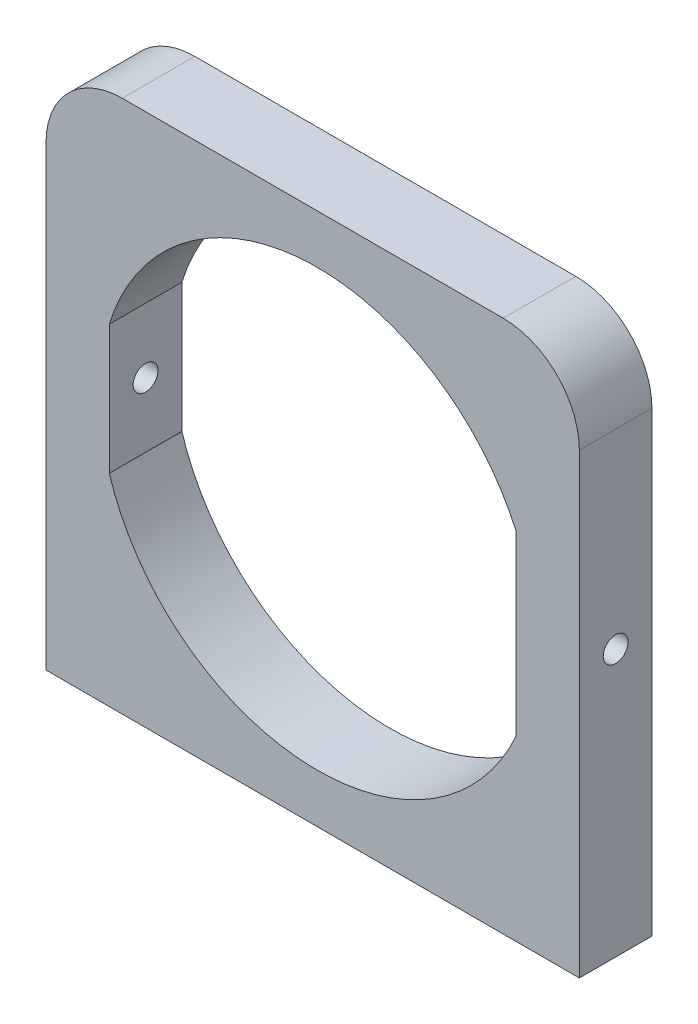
from build123d import *

# Parameters (mm, degrees)
SKETCH1_W                      = 70
SKETCH1_H                      = 70
BOSS_EXTRUDE1_DEPTH            = 9.525
F_4_CLEARANCE_HOLE1_D          = 3.2639
TAP_DRILL_FOR_8_32_TAP1_D      = 3.4544
TAP_DRILL_FOR_8_32_TAP1_DEPTH  = 12.7
TAP_DRILL_FOR_8_32_TAP1_TIP    = 1.037806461
F_1_8_0_1250_DOWEL_HOLE1_D     = 3.175
F_1_8_0_1250_DOWEL_HOLE1_DEPTH = 6.35
F_1_8_0_1250_DOWEL_HOLE1_TIP   = 0.953866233
CUT_EXTRUDE12_REACH            = 52.406
FILLET6_R                      = 10


with BuildPart() as part:
    # Sketch1 → Boss-Extrude1 (new body)
    with BuildSketch(Plane.XY):
        Rectangle(SKETCH1_W, SKETCH1_H)
    extrude(amount=BOSS_EXTRUDE1_DEPTH)

    # 4 Clearance Hole1 (through all)
    with Locations(Plane.ZY.offset(35)):
        with Locations((4.7625, 0)):
            Hole(F_4_CLEARANCE_HOLE1_D / 2)

    # Tap Drill for _8-32 Tap1
    with Locations(Plane(origin=(0, -35, 0), x_dir=(-1, 0, 0), z_dir=(0, -1, 0))):
        with Locations((28.65, -4.7625), (-28.65, -4.7625)):
            Hole(TAP_DRILL_FOR_8_32_TAP1_D / 2, depth=TAP_DRILL_FOR_8_32_TAP1_DEPTH)
            with Locations((0, 0, -(TAP_DRILL_FOR_8_32_TAP1_DEPTH + TAP_DRILL_FOR_8_32_TAP1_TIP / 2))):  # 118° drill point
                Cone(0, TAP_DRILL_FOR_8_32_TAP1_D / 2, TAP_DRILL_FOR_8_32_TAP1_TIP, mode=Mode.SUBTRACT)

    # 1_8 _0.1250_ Dowel Hole1
    with Locations(Plane(origin=(0, -35, 0), x_dir=(-1, 0, 0), z_dir=(0, -1, 0))):
        with Locations((15.95, -4.7625), (-15.95, -4.7625)):
            Hole(F_1_8_0_1250_DOWEL_HOLE1_D / 2, depth=F_1_8_0_1250_DOWEL_HOLE1_DEPTH)
            with Locations((0, 0, -(F_1_8_0_1250_DOWEL_HOLE1_DEPTH + F_1_8_0_1250_DOWEL_HOLE1_TIP / 2))):  # 118° drill point
                Cone(0, F_1_8_0_1250_DOWEL_HOLE1_D / 2, F_1_8_0_1250_DOWEL_HOLE1_TIP, mode=Mode.SUBTRACT)

    # Sketch22 → Cut-Extrude12 (cut, up to next)
    with BuildSketch(Plane.XY.offset(9.525), mode=Mode.PRIVATE) as cut_extrude12_sk1:
        with BuildLine():
            Line((-26.7, 8.478625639), (-26.7, -8.478625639))
            ThreePointArc((-26.7, -8.478625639), (-1.090416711, -28.530355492), (26.7, -11.630196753))
            Line((26.7, -11.630196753), (26.7, 11.630196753))
            ThreePointArc((26.7, 11.630196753), (-1.090416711, 28.530355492), (-26.7, 8.478625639))
        make_face()
    cut_extrude12_tool1 = extrude(cut_extrude12_sk1.sketch, amount=-CUT_EXTRUDE12_REACH, mode=Mode.PRIVATE) & part.part
    add(cut_extrude12_tool1.solids().sort_by_distance((0.337738, 0, 9.525))[0], mode=Mode.SUBTRACT)

    # Fillet6
    fillet6_edges = [part.edges().sort_by_distance(p)[0] for p in [
        (-35, 35, 4.7625),
        (35, 35, 4.7625),
    ]]
    fillet(fillet6_edges, radius=FILLET6_R)


solid = part.part
